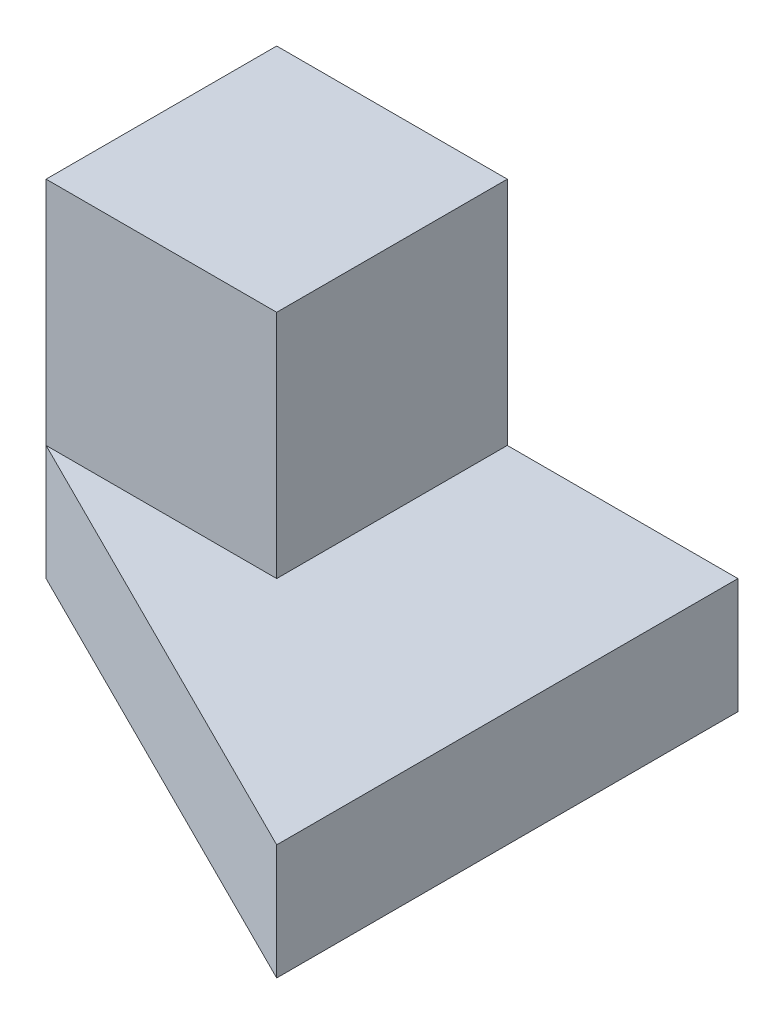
ISO-10303-21;
HEADER;
FILE_DESCRIPTION(('STEP AP214'),'2;1');
FILE_NAME('part.step','',(''),(''),'','','');
FILE_SCHEMA(('AUTOMOTIVE_DESIGN { 1 0 10303 214 1 1 1 1 }'));
ENDSEC;
DATA;
#1=APPLICATION_CONTEXT('core data for automotive mechanical design processes');
#2=APPLICATION_PROTOCOL_DEFINITION('international standard','automotive_design',2000,#1);
#3=PRODUCT_CONTEXT('',#1,'mechanical');
#4=PRODUCT('Part','Part','',(#3));
#5=PRODUCT_RELATED_PRODUCT_CATEGORY('part','',(#4));
#6=PRODUCT_DEFINITION_FORMATION('','',#4);
#7=PRODUCT_DEFINITION_CONTEXT('part definition',#1,'design');
#8=PRODUCT_DEFINITION('design','',#6,#7);
#9=PRODUCT_DEFINITION_SHAPE('','',#8);
#10=(LENGTH_UNIT() NAMED_UNIT(*) SI_UNIT(.MILLI.,.METRE.));
#11=(NAMED_UNIT(*) PLANE_ANGLE_UNIT() SI_UNIT($,.RADIAN.));
#12=(NAMED_UNIT(*) SI_UNIT($,.STERADIAN.) SOLID_ANGLE_UNIT());
#13=UNCERTAINTY_MEASURE_WITH_UNIT(LENGTH_MEASURE(1.E-05),#10,'distance_accuracy_value','');
#14=(GEOMETRIC_REPRESENTATION_CONTEXT(3) GLOBAL_UNCERTAINTY_ASSIGNED_CONTEXT((#13)) GLOBAL_UNIT_ASSIGNED_CONTEXT((#10,
#11,#12)) REPRESENTATION_CONTEXT('',''));
#15=CARTESIAN_POINT('',(0.,0.,0.));
#16=DIRECTION('',(0.,0.,1.));
#17=DIRECTION('',(1.,0.,0.));
#18=AXIS2_PLACEMENT_3D('',#15,#16,#17);
#19=CARTESIAN_POINT('',(-19.3131370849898,10.,-9.65656854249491));
#20=DIRECTION('',(-0.447213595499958,0.,0.894427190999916));
#21=DIRECTION('',(0.894427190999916,0.,0.447213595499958));
#22=AXIS2_PLACEMENT_3D('',#19,#20,#21);
#23=PLANE('',#22);
#24=DIRECTION('',(-0.894427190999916,0.,-0.447213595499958));
#25=VECTOR('',#24,1.);
#26=CARTESIAN_POINT('',(-19.3131370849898,0.,-9.65656854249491));
#27=LINE('',#26,#25);
#28=CARTESIAN_POINT('',(40.,0.,20.));
#29=VERTEX_POINT('',#28);
#30=CARTESIAN_POINT('',(0.,0.,0.));
#31=VERTEX_POINT('',#30);
#32=EDGE_CURVE('E115',#29,#31,#27,.T.);
#33=ORIENTED_EDGE('',*,*,#32,.F.);
#34=DIRECTION('',(0.,-1.,0.));
#35=VECTOR('',#34,1.);
#36=CARTESIAN_POINT('',(40.,10.,20.));
#37=LINE('',#36,#35);
#38=CARTESIAN_POINT('',(40.,10.,20.));
#39=VERTEX_POINT('',#38);
#40=EDGE_CURVE('E11',#39,#29,#37,.T.);
#41=ORIENTED_EDGE('',*,*,#40,.F.);
#42=DIRECTION('',(-0.894427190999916,0.,-0.447213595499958));
#43=VECTOR('',#42,1.);
#44=CARTESIAN_POINT('',(-19.3131370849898,10.,-9.65656854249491));
#45=LINE('',#44,#43);
#46=CARTESIAN_POINT('',(0.,10.,0.));
#47=VERTEX_POINT('',#46);
#48=EDGE_CURVE('E123',#39,#47,#45,.T.);
#49=ORIENTED_EDGE('',*,*,#48,.T.);
#50=DIRECTION('',(0.,-1.,0.));
#51=VECTOR('',#50,1.);
#52=CARTESIAN_POINT('',(0.,10.,0.));
#53=LINE('',#52,#51);
#54=EDGE_CURVE('E74',#47,#31,#53,.T.);
#55=ORIENTED_EDGE('',*,*,#54,.T.);
#56=EDGE_LOOP('',(#33,#41,#49,#55));
#57=FACE_BOUND('',#56,.T.);
#58=ADVANCED_FACE('F32',(#57),#23,.T.);
#59=CARTESIAN_POINT('',(40.,10.,0.));
#60=DIRECTION('',(1.,0.,0.));
#61=DIRECTION('',(0.,0.,-1.));
#62=AXIS2_PLACEMENT_3D('',#59,#60,#61);
#63=PLANE('',#62);
#64=DIRECTION('',(0.,0.,1.));
#65=VECTOR('',#64,1.);
#66=CARTESIAN_POINT('',(40.,0.,0.));
#67=LINE('',#66,#65);
#68=CARTESIAN_POINT('',(40.,0.,-20.));
#69=VERTEX_POINT('',#68);
#70=EDGE_CURVE('E117',#69,#29,#67,.T.);
#71=ORIENTED_EDGE('',*,*,#70,.F.);
#72=DIRECTION('',(0.,-1.,0.));
#73=VECTOR('',#72,1.);
#74=CARTESIAN_POINT('',(40.,10.,-20.));
#75=LINE('',#74,#73);
#76=CARTESIAN_POINT('',(40.,10.,-20.));
#77=VERTEX_POINT('',#76);
#78=EDGE_CURVE('E40',#77,#69,#75,.T.);
#79=ORIENTED_EDGE('',*,*,#78,.F.);
#80=DIRECTION('',(0.,0.,1.));
#81=VECTOR('',#80,1.);
#82=CARTESIAN_POINT('',(40.,10.,0.));
#83=LINE('',#82,#81);
#84=EDGE_CURVE('E125',#77,#39,#83,.T.);
#85=ORIENTED_EDGE('',*,*,#84,.T.);
#86=ORIENTED_EDGE('',*,*,#40,.T.);
#87=EDGE_LOOP('',(#71,#79,#85,#86));
#88=FACE_BOUND('',#87,.T.);
#89=ADVANCED_FACE('F159',(#88),#63,.T.);
#90=CARTESIAN_POINT('',(-24.1414213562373,10.,-20.));
#91=DIRECTION('',(0.,0.,-1.));
#92=DIRECTION('',(-1.,0.,0.));
#93=AXIS2_PLACEMENT_3D('',#90,#91,#92);
#94=PLANE('',#93);
#95=DIRECTION('',(1.,0.,0.));
#96=VECTOR('',#95,1.);
#97=CARTESIAN_POINT('',(-24.1414213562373,0.,-20.));
#98=LINE('',#97,#96);
#99=CARTESIAN_POINT('',(0.,0.,-20.));
#100=VERTEX_POINT('',#99);
#101=EDGE_CURVE('E147',#100,#69,#98,.T.);
#102=ORIENTED_EDGE('',*,*,#101,.F.);
#103=DIRECTION('',(0.,-1.,0.));
#104=VECTOR('',#103,1.);
#105=CARTESIAN_POINT('',(0.,10.,-20.));
#106=LINE('',#105,#104);
#107=CARTESIAN_POINT('',(0.,30.,-20.));
#108=VERTEX_POINT('',#107);
#109=EDGE_CURVE('E145',#108,#100,#106,.T.);
#110=ORIENTED_EDGE('',*,*,#109,.F.);
#111=DIRECTION('',(-1.,0.,0.));
#112=VECTOR('',#111,1.);
#113=CARTESIAN_POINT('',(0.,30.,-20.));
#114=LINE('',#113,#112);
#115=CARTESIAN_POINT('',(20.,30.,-20.));
#116=VERTEX_POINT('',#115);
#117=EDGE_CURVE('E109',#116,#108,#114,.T.);
#118=ORIENTED_EDGE('',*,*,#117,.F.);
#119=DIRECTION('',(0.,-1.,0.));
#120=VECTOR('',#119,1.);
#121=CARTESIAN_POINT('',(20.,30.,-20.));
#122=LINE('',#121,#120);
#123=CARTESIAN_POINT('',(20.,10.,-20.));
#124=VERTEX_POINT('',#123);
#125=EDGE_CURVE('E119',#116,#124,#122,.T.);
#126=ORIENTED_EDGE('',*,*,#125,.T.);
#127=DIRECTION('',(1.,0.,0.));
#128=VECTOR('',#127,1.);
#129=CARTESIAN_POINT('',(-24.1414213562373,10.,-20.));
#130=LINE('',#129,#128);
#131=EDGE_CURVE('E48',#124,#77,#130,.T.);
#132=ORIENTED_EDGE('',*,*,#131,.T.);
#133=ORIENTED_EDGE('',*,*,#78,.T.);
#134=EDGE_LOOP('',(#102,#110,#118,#126,#132,#133));
#135=FACE_BOUND('',#134,.T.);
#136=ADVANCED_FACE('F144',(#135),#94,.T.);
#137=CARTESIAN_POINT('',(0.,10.,0.));
#138=DIRECTION('',(-1.,0.,0.));
#139=DIRECTION('',(0.,0.,1.));
#140=AXIS2_PLACEMENT_3D('',#137,#138,#139);
#141=PLANE('',#140);
#142=DIRECTION('',(0.,0.,-1.));
#143=VECTOR('',#142,1.);
#144=CARTESIAN_POINT('',(0.,0.,0.));
#145=LINE('',#144,#143);
#146=EDGE_CURVE('E126',#31,#100,#145,.T.);
#147=ORIENTED_EDGE('',*,*,#146,.F.);
#148=ORIENTED_EDGE('',*,*,#54,.F.);
#149=DIRECTION('',(0.,-1.,0.));
#150=VECTOR('',#149,1.);
#151=CARTESIAN_POINT('',(0.,30.,0.));
#152=LINE('',#151,#150);
#153=CARTESIAN_POINT('',(0.,30.,0.));
#154=VERTEX_POINT('',#153);
#155=EDGE_CURVE('E97',#154,#47,#152,.T.);
#156=ORIENTED_EDGE('',*,*,#155,.F.);
#157=DIRECTION('',(0.,0.,1.));
#158=VECTOR('',#157,1.);
#159=CARTESIAN_POINT('',(0.,30.,0.));
#160=LINE('',#159,#158);
#161=EDGE_CURVE('E103',#108,#154,#160,.T.);
#162=ORIENTED_EDGE('',*,*,#161,.F.);
#163=ORIENTED_EDGE('',*,*,#109,.T.);
#164=EDGE_LOOP('',(#147,#148,#156,#162,#163));
#165=FACE_BOUND('',#164,.T.);
#166=ADVANCED_FACE('F114',(#165),#141,.T.);
#167=CARTESIAN_POINT('',(-24.1414213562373,10.,0.));
#168=DIRECTION('',(0.,1.,0.));
#169=DIRECTION('',(0.,0.,1.));
#170=AXIS2_PLACEMENT_3D('',#167,#168,#169);
#171=PLANE('',#170);
#172=DIRECTION('',(0.,0.,-1.));
#173=VECTOR('',#172,1.);
#174=CARTESIAN_POINT('',(20.,10.,0.));
#175=LINE('',#174,#173);
#176=CARTESIAN_POINT('',(20.,10.,0.));
#177=VERTEX_POINT('',#176);
#178=EDGE_CURVE('E111',#177,#124,#175,.T.);
#179=ORIENTED_EDGE('',*,*,#178,.F.);
#180=DIRECTION('',(1.,0.,0.));
#181=VECTOR('',#180,1.);
#182=CARTESIAN_POINT('',(0.,10.,0.));
#183=LINE('',#182,#181);
#184=EDGE_CURVE('E55',#47,#177,#183,.T.);
#185=ORIENTED_EDGE('',*,*,#184,.F.);
#186=ORIENTED_EDGE('',*,*,#48,.F.);
#187=ORIENTED_EDGE('',*,*,#84,.F.);
#188=ORIENTED_EDGE('',*,*,#131,.F.);
#189=EDGE_LOOP('',(#179,#185,#186,#187,#188));
#190=FACE_BOUND('',#189,.T.);
#191=ADVANCED_FACE('F171',(#190),#171,.T.);
#192=CARTESIAN_POINT('',(-24.1414213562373,0.,0.));
#193=DIRECTION('',(0.,1.,0.));
#194=DIRECTION('',(0.,0.,1.));
#195=AXIS2_PLACEMENT_3D('',#192,#193,#194);
#196=PLANE('',#195);
#197=ORIENTED_EDGE('',*,*,#32,.T.);
#198=ORIENTED_EDGE('',*,*,#146,.T.);
#199=ORIENTED_EDGE('',*,*,#101,.T.);
#200=ORIENTED_EDGE('',*,*,#70,.T.);
#201=EDGE_LOOP('',(#197,#198,#199,#200));
#202=FACE_BOUND('',#201,.T.);
#203=ADVANCED_FACE('F156',(#202),#196,.F.);
#204=CARTESIAN_POINT('',(0.,30.,0.));
#205=DIRECTION('',(0.,0.,-1.));
#206=DIRECTION('',(-1.,0.,0.));
#207=AXIS2_PLACEMENT_3D('',#204,#205,#206);
#208=PLANE('',#207);
#209=ORIENTED_EDGE('',*,*,#184,.T.);
#210=DIRECTION('',(0.,-1.,0.));
#211=VECTOR('',#210,1.);
#212=CARTESIAN_POINT('',(20.,30.,0.));
#213=LINE('',#212,#211);
#214=CARTESIAN_POINT('',(20.,30.,0.));
#215=VERTEX_POINT('',#214);
#216=EDGE_CURVE('E99',#215,#177,#213,.T.);
#217=ORIENTED_EDGE('',*,*,#216,.F.);
#218=DIRECTION('',(1.,0.,0.));
#219=VECTOR('',#218,1.);
#220=CARTESIAN_POINT('',(0.,30.,0.));
#221=LINE('',#220,#219);
#222=EDGE_CURVE('E93',#154,#215,#221,.T.);
#223=ORIENTED_EDGE('',*,*,#222,.F.);
#224=ORIENTED_EDGE('',*,*,#155,.T.);
#225=EDGE_LOOP('',(#209,#217,#223,#224));
#226=FACE_BOUND('',#225,.T.);
#227=ADVANCED_FACE('F95',(#226),#208,.F.);
#228=CARTESIAN_POINT('',(20.,30.,0.));
#229=DIRECTION('',(-1.,0.,0.));
#230=DIRECTION('',(0.,0.,1.));
#231=AXIS2_PLACEMENT_3D('',#228,#229,#230);
#232=PLANE('',#231);
#233=ORIENTED_EDGE('',*,*,#178,.T.);
#234=ORIENTED_EDGE('',*,*,#125,.F.);
#235=DIRECTION('',(0.,0.,-1.));
#236=VECTOR('',#235,1.);
#237=CARTESIAN_POINT('',(20.,30.,0.));
#238=LINE('',#237,#236);
#239=EDGE_CURVE('E102',#215,#116,#238,.T.);
#240=ORIENTED_EDGE('',*,*,#239,.F.);
#241=ORIENTED_EDGE('',*,*,#216,.T.);
#242=EDGE_LOOP('',(#233,#234,#240,#241));
#243=FACE_BOUND('',#242,.T.);
#244=ADVANCED_FACE('F141',(#243),#232,.F.);
#245=CARTESIAN_POINT('',(0.,30.,-20.));
#246=DIRECTION('',(0.,-1.,0.));
#247=DIRECTION('',(0.,0.,-1.));
#248=AXIS2_PLACEMENT_3D('',#245,#246,#247);
#249=PLANE('',#248);
#250=ORIENTED_EDGE('',*,*,#161,.T.);
#251=ORIENTED_EDGE('',*,*,#222,.T.);
#252=ORIENTED_EDGE('',*,*,#239,.T.);
#253=ORIENTED_EDGE('',*,*,#117,.T.);
#254=EDGE_LOOP('',(#250,#251,#252,#253));
#255=FACE_BOUND('',#254,.T.);
#256=ADVANCED_FACE('F107',(#255),#249,.F.);
#257=CLOSED_SHELL('',(#58,#89,#136,#166,#191,#203,#227,#244,#256));
#258=MANIFOLD_SOLID_BREP('B2',#257);
#259=ADVANCED_BREP_SHAPE_REPRESENTATION('',(#18,#258),#14);
#260=SHAPE_DEFINITION_REPRESENTATION(#9,#259);
ENDSEC;
END-ISO-10303-21;
